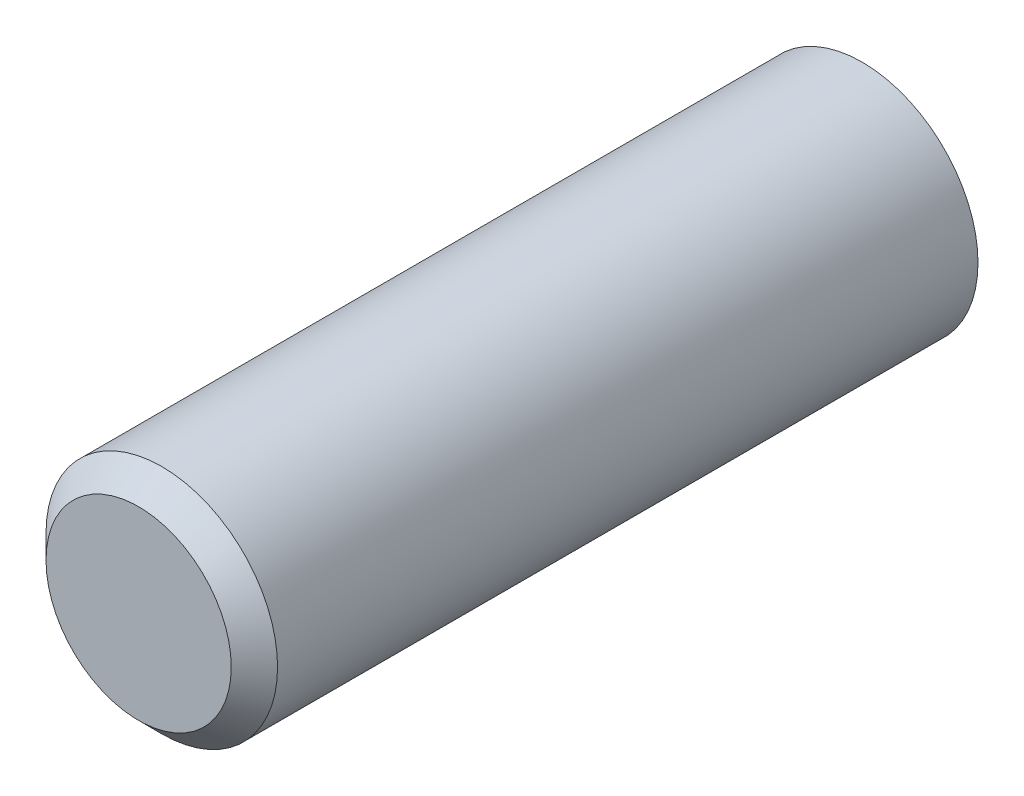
from build123d import *

# Parameters (mm, degrees)
SKETCH2_R           = 8
BOSS_EXTRUDE1_DEPTH = 25
CHAMFER1_SIZE       = 1.6


with BuildPart() as part:
    # Sketch2 → Boss-Extrude1 (new, symmetric)
    with BuildSketch(Plane.XY):
        Circle(SKETCH2_R)
    extrude(amount=BOSS_EXTRUDE1_DEPTH, both=True)

    # Chamfer1
    chamfer1_edges = [part.edges().sort_by_distance(p)[0] for p in [
        (-8, 0, 25),
    ]]
    chamfer(chamfer1_edges, length=CHAMFER1_SIZE)


solid = part.part
